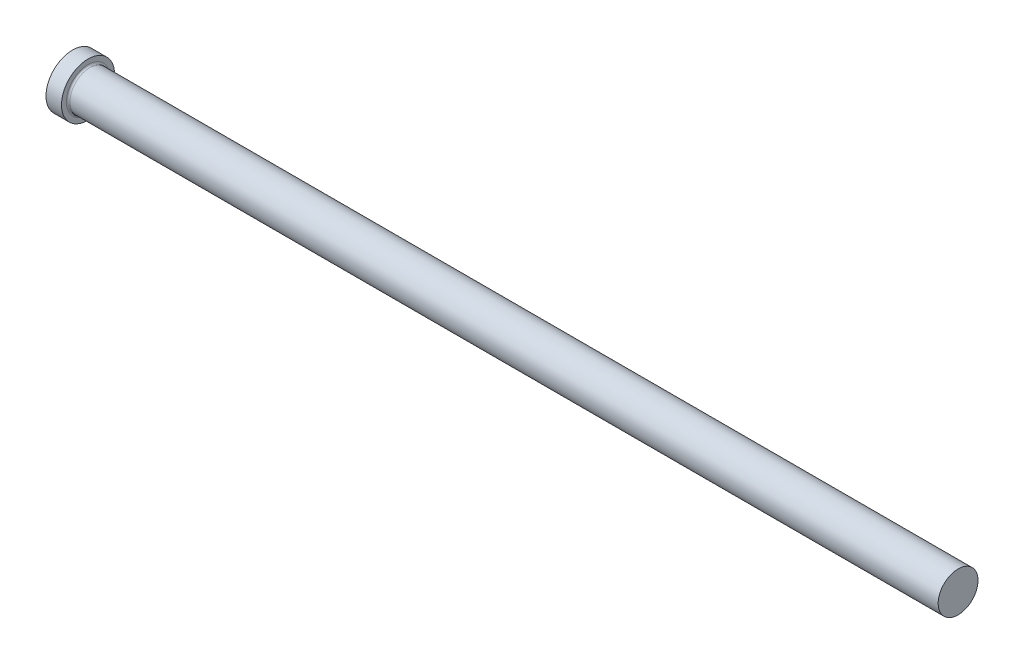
ISO-10303-21;
HEADER;
FILE_DESCRIPTION(('STEP AP214'),'2;1');
FILE_NAME('part.step','',(''),(''),'','','');
FILE_SCHEMA(('AUTOMOTIVE_DESIGN { 1 0 10303 214 1 1 1 1 }'));
ENDSEC;
DATA;
#1=APPLICATION_CONTEXT('core data for automotive mechanical design processes');
#2=APPLICATION_PROTOCOL_DEFINITION('international standard','automotive_design',2000,#1);
#3=PRODUCT_CONTEXT('',#1,'mechanical');
#4=PRODUCT('Part','Part','',(#3));
#5=PRODUCT_RELATED_PRODUCT_CATEGORY('part','',(#4));
#6=PRODUCT_DEFINITION_FORMATION('','',#4);
#7=PRODUCT_DEFINITION_CONTEXT('part definition',#1,'design');
#8=PRODUCT_DEFINITION('design','',#6,#7);
#9=PRODUCT_DEFINITION_SHAPE('','',#8);
#10=(LENGTH_UNIT() NAMED_UNIT(*) SI_UNIT(.MILLI.,.METRE.));
#11=(NAMED_UNIT(*) PLANE_ANGLE_UNIT() SI_UNIT($,.RADIAN.));
#12=(NAMED_UNIT(*) SI_UNIT($,.STERADIAN.) SOLID_ANGLE_UNIT());
#13=UNCERTAINTY_MEASURE_WITH_UNIT(LENGTH_MEASURE(1.E-05),#10,'distance_accuracy_value','');
#14=(GEOMETRIC_REPRESENTATION_CONTEXT(3) GLOBAL_UNCERTAINTY_ASSIGNED_CONTEXT((#13)) GLOBAL_UNIT_ASSIGNED_CONTEXT((#10,
#11,#12)) REPRESENTATION_CONTEXT('',''));
#15=CARTESIAN_POINT('',(0.,0.,0.));
#16=DIRECTION('',(0.,0.,1.));
#17=DIRECTION('',(1.,0.,0.));
#18=AXIS2_PLACEMENT_3D('',#15,#16,#17);
#19=CARTESIAN_POINT('',(0.,0.,0.));
#20=DIRECTION('',(-1.,0.,0.));
#21=DIRECTION('',(0.,-1.,0.));
#22=AXIS2_PLACEMENT_3D('',#19,#20,#21);
#23=PLANE('',#22);
#24=CARTESIAN_POINT('',(0.,0.,0.));
#25=DIRECTION('',(1.,0.,0.));
#26=DIRECTION('',(0.,1.,0.));
#27=AXIS2_PLACEMENT_3D('',#24,#25,#26);
#28=CIRCLE('',#27,12.);
#29=CARTESIAN_POINT('',(0.,12.,0.));
#30=VERTEX_POINT('',#29);
#31=EDGE_CURVE('E25',#30,#30,#28,.T.);
#32=ORIENTED_EDGE('',*,*,#31,.F.);
#33=EDGE_LOOP('',(#32));
#34=FACE_BOUND('',#33,.T.);
#35=ADVANCED_FACE('F14',(#34),#23,.T.);
#36=CARTESIAN_POINT('',(400.,0.,0.));
#37=DIRECTION('',(1.,0.,0.));
#38=DIRECTION('',(0.,1.,0.));
#39=AXIS2_PLACEMENT_3D('',#36,#37,#38);
#40=CYLINDRICAL_SURFACE('',#39,12.);
#41=ORIENTED_EDGE('',*,*,#31,.T.);
#42=EDGE_LOOP('',(#41));
#43=FACE_BOUND('',#42,.T.);
#44=CARTESIAN_POINT('',(7.,0.,0.));
#45=DIRECTION('',(1.,0.,0.));
#46=DIRECTION('',(0.,1.,0.));
#47=AXIS2_PLACEMENT_3D('',#44,#45,#46);
#48=CIRCLE('',#47,12.);
#49=CARTESIAN_POINT('',(7.,12.,0.));
#50=VERTEX_POINT('',#49);
#51=EDGE_CURVE('E29',#50,#50,#48,.T.);
#52=ORIENTED_EDGE('',*,*,#51,.F.);
#53=EDGE_LOOP('',(#52));
#54=FACE_BOUND('',#53,.T.);
#55=ADVANCED_FACE('F51',(#43,#54),#40,.T.);
#56=CARTESIAN_POINT('',(7.,12.,0.));
#57=DIRECTION('',(1.,0.,0.));
#58=DIRECTION('',(0.,1.,0.));
#59=AXIS2_PLACEMENT_3D('',#56,#57,#58);
#60=PLANE('',#59);
#61=CARTESIAN_POINT('',(7.,0.,0.));
#62=DIRECTION('',(1.,0.,0.));
#63=DIRECTION('',(0.,1.,0.));
#64=AXIS2_PLACEMENT_3D('',#61,#62,#63);
#65=CIRCLE('',#64,9.8);
#66=CARTESIAN_POINT('',(7.,9.8,0.));
#67=VERTEX_POINT('',#66);
#68=EDGE_CURVE('E9',#67,#67,#65,.F.);
#69=ORIENTED_EDGE('',*,*,#68,.T.);
#70=EDGE_LOOP('',(#69));
#71=FACE_BOUND('',#70,.T.);
#72=ORIENTED_EDGE('',*,*,#51,.T.);
#73=EDGE_LOOP('',(#72));
#74=FACE_BOUND('',#73,.T.);
#75=ADVANCED_FACE('F42',(#71,#74),#60,.T.);
#76=CARTESIAN_POINT('',(400.,0.,0.));
#77=DIRECTION('',(1.,0.,0.));
#78=DIRECTION('',(0.,1.,0.));
#79=AXIS2_PLACEMENT_3D('',#76,#77,#78);
#80=CYLINDRICAL_SURFACE('',#79,9.);
#81=CARTESIAN_POINT('',(7.8,0.,0.));
#82=DIRECTION('',(1.,0.,0.));
#83=DIRECTION('',(0.,1.,0.));
#84=AXIS2_PLACEMENT_3D('',#81,#82,#83);
#85=CIRCLE('',#84,9.);
#86=CARTESIAN_POINT('',(7.8,9.,0.));
#87=VERTEX_POINT('',#86);
#88=EDGE_CURVE('E21',#87,#87,#85,.T.);
#89=ORIENTED_EDGE('',*,*,#88,.T.);
#90=EDGE_LOOP('',(#89));
#91=FACE_BOUND('',#90,.T.);
#92=CARTESIAN_POINT('',(400.,0.,0.));
#93=DIRECTION('',(1.,0.,0.));
#94=DIRECTION('',(0.,1.,0.));
#95=AXIS2_PLACEMENT_3D('',#92,#93,#94);
#96=CIRCLE('',#95,9.);
#97=CARTESIAN_POINT('',(400.,9.00000000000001,0.));
#98=VERTEX_POINT('',#97);
#99=EDGE_CURVE('E34',#98,#98,#96,.T.);
#100=ORIENTED_EDGE('',*,*,#99,.F.);
#101=EDGE_LOOP('',(#100));
#102=FACE_BOUND('',#101,.T.);
#103=ADVANCED_FACE('F40',(#91,#102),#80,.T.);
#104=CARTESIAN_POINT('',(400.,9.,0.));
#105=DIRECTION('',(1.,0.,0.));
#106=DIRECTION('',(0.,1.,0.));
#107=AXIS2_PLACEMENT_3D('',#104,#105,#106);
#108=PLANE('',#107);
#109=ORIENTED_EDGE('',*,*,#99,.T.);
#110=EDGE_LOOP('',(#109));
#111=FACE_BOUND('',#110,.T.);
#112=ADVANCED_FACE('F38',(#111),#108,.T.);
#113=CARTESIAN_POINT('',(7.8,0.,0.));
#114=DIRECTION('',(1.,0.,0.));
#115=DIRECTION('',(0.,1.,0.));
#116=AXIS2_PLACEMENT_3D('',#113,#114,#115);
#117=TOROIDAL_SURFACE('',#116,9.8,0.8);
#118=ORIENTED_EDGE('',*,*,#68,.F.);
#119=EDGE_LOOP('',(#118));
#120=FACE_BOUND('',#119,.T.);
#121=ORIENTED_EDGE('',*,*,#88,.F.);
#122=EDGE_LOOP('',(#121));
#123=FACE_BOUND('',#122,.T.);
#124=ADVANCED_FACE('F16',(#120,#123),#117,.F.);
#125=CLOSED_SHELL('',(#35,#55,#75,#103,#112,#124));
#126=MANIFOLD_SOLID_BREP('B1',#125);
#127=ADVANCED_BREP_SHAPE_REPRESENTATION('',(#18,#126),#14);
#128=SHAPE_DEFINITION_REPRESENTATION(#9,#127);
ENDSEC;
END-ISO-10303-21;
